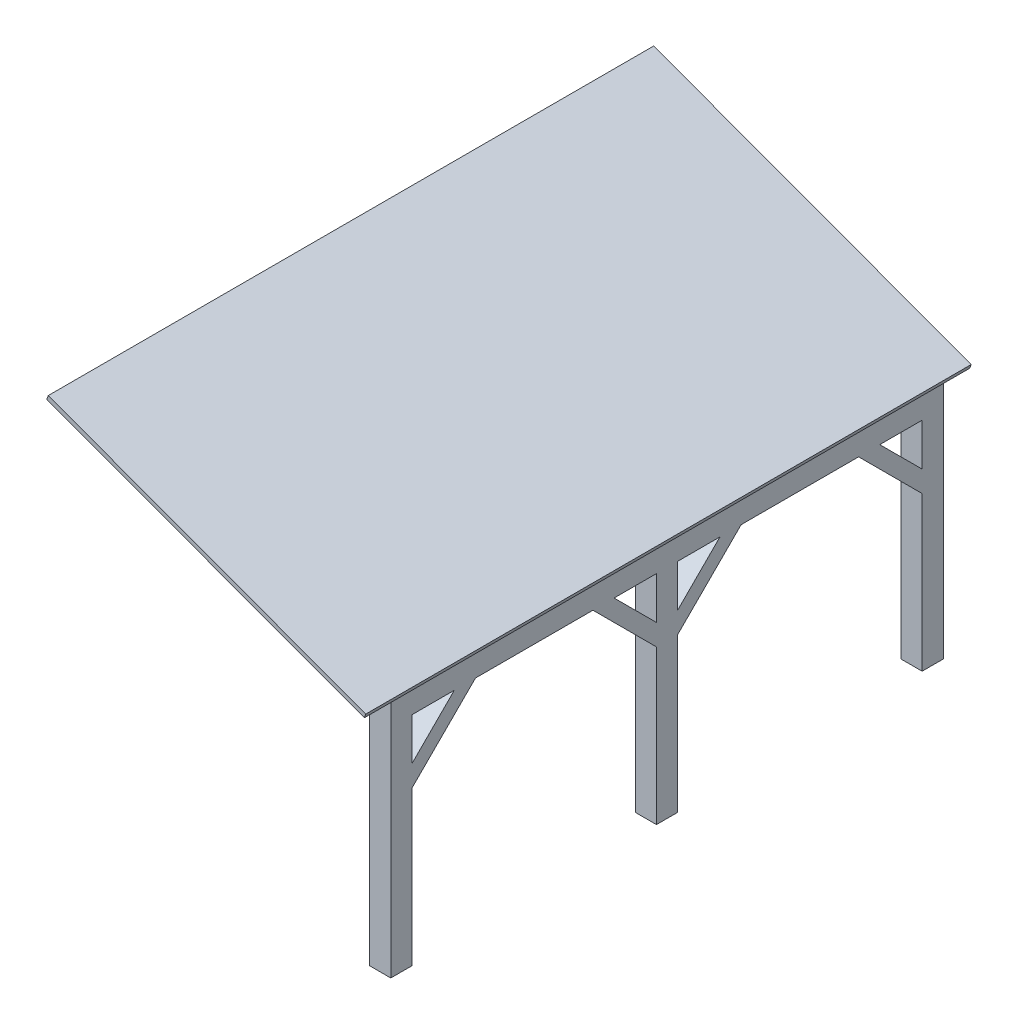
from build123d import *

# Parameters (mm, degrees)
EXTRUSION1_DEPTH         = 26.1
COQUE1_T                 = -1
ESQUISSE2_W              = 13
ESQUISSE2_H              = 26.1
ENL_V_MAT_EXTRU_1_DEPTH  = 26.1
ENL_V_MAT_EXTRU_2_DEPTH  = 26.1
ENL_V_MAT_EXTRU_5_DEPTH  = 35.473903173
ENL_V_MAT_EXTRU_6_DEPTH  = 1
ENL_V_MAT_EXTRU_7_DEPTH  = 1
ENL_V_MAT_EXTRU_8_DEPTH  = 1
ENL_V_MAT_EXTRU_9_DEPTH  = 1
ENL_V_MAT_EXTRU_10_DEPTH = 1
ENL_V_MAT_EXTRU_11_DEPTH = 1
ESQUISSE12_W             = 15.986897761
ESQUISSE12_H             = 26.1
EXTRUSION2_DEPTH         = 0.2
EXTRUSION3_DEPTH         = 1.25
EXTRUSION4_DEPTH         = 1.25


with BuildPart() as part:
    # Esquisse1 → Extrusion1 (new body)
    with BuildSketch(Plane.XY):
        Polygon((0, 0), (0, 16.8), (15, 11.27), (15, 0), align=None)
    extrude(amount=EXTRUSION1_DEPTH)

    # Coque1
    coque1_openings = [part.faces().sort_by_distance(p)[0] for p in [
        (7.007481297, 7.108287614, 26.1),
    ]]
    offset(amount=COQUE1_T, openings=coque1_openings, kind=Kind.INTERSECTION)

    # Esquisse2 → Enl_v. mat.-Extru.1 (cut)
    with BuildSketch(Plane(origin=(0, 1, 0), x_dir=(1, 0, 0), z_dir=(0, 1, 0))):
        with Locations((7.5, -13.05)):
            Rectangle(ESQUISSE2_W, ESQUISSE2_H)
    extrude(amount=-ENL_V_MAT_EXTRU_1_DEPTH, mode=Mode.SUBTRACT)

    # Esquisse4 → Enl_v. mat.-Extru.2 (cut)
    with BuildSketch(Plane.XY.offset(1)):
        Polygon((1, 1), (1, 15.365540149), (14, 10.572873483), (14, 1), align=None)
    extrude(amount=-ENL_V_MAT_EXTRU_2_DEPTH, mode=Mode.SUBTRACT)

    # Esquisse6 → Enl_v. mat.-Extru.5 (cut, through all)
    with BuildSketch(Plane.XY.offset(26.1)):
        Polygon((0, 0), (1, 0), (1, 15.365540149), (0, 15.735419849), align=None)
    extrude(amount=-ENL_V_MAT_EXTRU_5_DEPTH, mode=Mode.SUBTRACT)

    # Esquisse7 → Enl_v. mat.-Extru.6 (cut)
    with BuildSketch(Plane(origin=(15, 0, 0), x_dir=(0, 0, -1), z_dir=(1, 0, 0))):
        Polygon((-25.1, 7.27), (-25.1, 0), (-13.55, 0), (-13.55, 7.27), (-16.55, 10.27), (-22.1, 10.27), align=None)
    extrude(amount=-ENL_V_MAT_EXTRU_6_DEPTH, mode=Mode.SUBTRACT)

    # Esquisse7_3 → Enl_v. mat.-Extru.7 (cut)
    with BuildSketch(Plane(origin=(15, 0, 0), x_dir=(0, 0, -1), z_dir=(1, 0, 0))):
        Polygon((-12.55, 7.27), (-12.55, 0), (-1, 0), (-1, 7.27), (-4, 10.27), (-9.55, 10.27), align=None)
    extrude(amount=-ENL_V_MAT_EXTRU_7_DEPTH, mode=Mode.SUBTRACT)

    # Esquisse8 → Enl_v. mat.-Extru.8 (cut)
    with BuildSketch(Plane(origin=(15, 0, 0), x_dir=(0, 0, -1), z_dir=(1, 0, 0))):
        Polygon((-25.1, 10.27), (-23.1, 10.27), (-25.1, 8.27), align=None)
    extrude(amount=-ENL_V_MAT_EXTRU_8_DEPTH, mode=Mode.SUBTRACT)

    # Esquisse9 → Enl_v. mat.-Extru.9 (cut)
    with BuildSketch(Plane(origin=(15, 0, 0), x_dir=(0, 0, -1), z_dir=(1, 0, 0))):
        Polygon((-3, 10.27), (-1, 10.27), (-1, 8.27), align=None)
    extrude(amount=-ENL_V_MAT_EXTRU_9_DEPTH, mode=Mode.SUBTRACT)

    # Esquisse10 → Enl_v. mat.-Extru.10 (cut)
    with BuildSketch(Plane(origin=(15, 0, 0), x_dir=(0, 0, -1), z_dir=(1, 0, 0))):
        Polygon((-15.55, 10.27), (-13.55, 10.27), (-13.55, 8.27), align=None)
    extrude(amount=-ENL_V_MAT_EXTRU_10_DEPTH, mode=Mode.SUBTRACT)

    # Esquisse11 → Enl_v. mat.-Extru.11 (cut)
    with BuildSketch(Plane(origin=(15, 0, 0), x_dir=(0, 0, -1), z_dir=(1, 0, 0))):
        Polygon((-12.55, 8.27), (-12.55, 10.27), (-10.55, 10.27), align=None)
    extrude(amount=-ENL_V_MAT_EXTRU_11_DEPTH, mode=Mode.SUBTRACT)

    # Esquisse12 → Extrusion2 (add)
    with BuildSketch(Plane(origin=(5.452520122, 14.789837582, 0), x_dir=(0.9382683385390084, -0.3459082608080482, 0), z_dir=(0.3459082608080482, 0.9382683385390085, 0))):
        with Locations((2.182190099, -13.05)):
            Rectangle(ESQUISSE12_W, ESQUISSE12_H)
    extrude(amount=EXTRUSION2_DEPTH)

    # Esquisse13 → Extrusion3 (add)
    with BuildSketch(Plane.XY.offset(26.1)):
        Polygon((0.069181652, 16.987653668), (15.069181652, 11.457653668), (15, 11.27), (0, 16.8), align=None)
    extrude(amount=EXTRUSION3_DEPTH)

    # Esquisse14 → Extrusion4 (add)
    with BuildSketch(Plane(origin=(0, 0, 0), x_dir=(-1, 0, 0), z_dir=(0, 0, -1))):
        Polygon((-0.069181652, 16.987653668), (-15.069181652, 11.457653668), (-15, 11.27), (-0.069181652, 16.774495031), align=None)
    extrude(amount=EXTRUSION4_DEPTH)


solid = part.part
